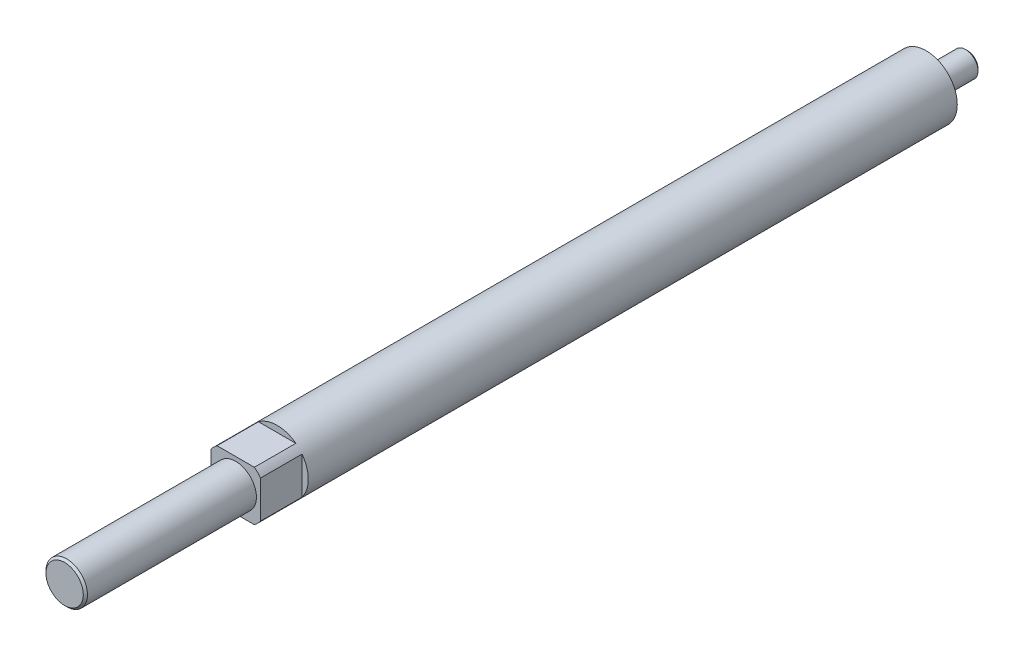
ISO-10303-21;
HEADER;
FILE_DESCRIPTION(('STEP AP214'),'2;1');
FILE_NAME('part.step','',(''),(''),'','','');
FILE_SCHEMA(('AUTOMOTIVE_DESIGN { 1 0 10303 214 1 1 1 1 }'));
ENDSEC;
DATA;
#1=APPLICATION_CONTEXT('core data for automotive mechanical design processes');
#2=APPLICATION_PROTOCOL_DEFINITION('international standard','automotive_design',2000,#1);
#3=PRODUCT_CONTEXT('',#1,'mechanical');
#4=PRODUCT('Part','Part','',(#3));
#5=PRODUCT_RELATED_PRODUCT_CATEGORY('part','',(#4));
#6=PRODUCT_DEFINITION_FORMATION('','',#4);
#7=PRODUCT_DEFINITION_CONTEXT('part definition',#1,'design');
#8=PRODUCT_DEFINITION('design','',#6,#7);
#9=PRODUCT_DEFINITION_SHAPE('','',#8);
#10=(LENGTH_UNIT() NAMED_UNIT(*) SI_UNIT(.MILLI.,.METRE.));
#11=(NAMED_UNIT(*) PLANE_ANGLE_UNIT() SI_UNIT($,.RADIAN.));
#12=(NAMED_UNIT(*) SI_UNIT($,.STERADIAN.) SOLID_ANGLE_UNIT());
#13=UNCERTAINTY_MEASURE_WITH_UNIT(LENGTH_MEASURE(1.E-05),#10,'distance_accuracy_value','');
#14=(GEOMETRIC_REPRESENTATION_CONTEXT(3) GLOBAL_UNCERTAINTY_ASSIGNED_CONTEXT((#13)) GLOBAL_UNIT_ASSIGNED_CONTEXT((#10,
#11,#12)) REPRESENTATION_CONTEXT('',''));
#15=CARTESIAN_POINT('',(0.,0.,0.));
#16=DIRECTION('',(0.,0.,1.));
#17=DIRECTION('',(1.,0.,0.));
#18=AXIS2_PLACEMENT_3D('',#15,#16,#17);
#19=CARTESIAN_POINT('',(0.,-1.59594559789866E-13,353.));
#20=DIRECTION('',(0.,0.,1.));
#21=DIRECTION('',(1.00000000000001,0.,0.));
#22=AXIS2_PLACEMENT_3D('',#19,#20,#21);
#23=PLANE('',#22);
#24=DIRECTION('',(0.,-1.00000000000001,0.));
#25=VECTOR('',#24,1.);
#26=CARTESIAN_POINT('',(12.0000000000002,12.,353.));
#27=LINE('',#26,#25);
#28=CARTESIAN_POINT('',(12.0000000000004,9.00000000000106,353.));
#29=VERTEX_POINT('',#28);
#30=CARTESIAN_POINT('',(12.0000000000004,-9.0000000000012,353.));
#31=VERTEX_POINT('',#30);
#32=EDGE_CURVE('E31',#29,#31,#27,.T.);
#33=ORIENTED_EDGE('',*,*,#32,.F.);
#34=CARTESIAN_POINT('',(0.,-1.59594559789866E-13,353.));
#35=DIRECTION('',(0.,0.,1.));
#36=DIRECTION('',(1.00000000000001,0.,0.));
#37=AXIS2_PLACEMENT_3D('',#34,#35,#36);
#38=CIRCLE('',#37,15.0000000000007);
#39=CARTESIAN_POINT('',(9.00000000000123,12.,353.));
#40=VERTEX_POINT('',#39);
#41=EDGE_CURVE('E101',#29,#40,#38,.T.);
#42=ORIENTED_EDGE('',*,*,#41,.T.);
#43=DIRECTION('',(1.00000000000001,0.,0.));
#44=VECTOR('',#43,1.);
#45=CARTESIAN_POINT('',(12.0000000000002,12.,353.));
#46=LINE('',#45,#44);
#47=CARTESIAN_POINT('',(-9.00000000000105,12.,353.));
#48=VERTEX_POINT('',#47);
#49=EDGE_CURVE('E84',#48,#40,#46,.T.);
#50=ORIENTED_EDGE('',*,*,#49,.F.);
#51=CARTESIAN_POINT('',(-12.,9.00000000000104,353.));
#52=VERTEX_POINT('',#51);
#53=EDGE_CURVE('E99',#48,#52,#38,.T.);
#54=ORIENTED_EDGE('',*,*,#53,.T.);
#55=DIRECTION('',(0.,1.00000000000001,0.));
#56=VECTOR('',#55,1.);
#57=CARTESIAN_POINT('',(-12.,12.,353.));
#58=LINE('',#57,#56);
#59=CARTESIAN_POINT('',(-12.,-9.00000000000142,353.));
#60=VERTEX_POINT('',#59);
#61=EDGE_CURVE('E103',#60,#52,#58,.T.);
#62=ORIENTED_EDGE('',*,*,#61,.F.);
#63=CARTESIAN_POINT('',(-9.00000000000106,-12.0000000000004,353.));
#64=VERTEX_POINT('',#63);
#65=EDGE_CURVE('E109',#60,#64,#38,.T.);
#66=ORIENTED_EDGE('',*,*,#65,.T.);
#67=DIRECTION('',(-1.00000000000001,0.,0.));
#68=VECTOR('',#67,1.);
#69=CARTESIAN_POINT('',(12.0000000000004,-12.0000000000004,353.));
#70=LINE('',#69,#68);
#71=CARTESIAN_POINT('',(9.00000000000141,-12.0000000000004,353.));
#72=VERTEX_POINT('',#71);
#73=EDGE_CURVE('E39',#72,#64,#70,.T.);
#74=ORIENTED_EDGE('',*,*,#73,.F.);
#75=EDGE_CURVE('E112',#72,#31,#38,.T.);
#76=ORIENTED_EDGE('',*,*,#75,.T.);
#77=EDGE_LOOP('',(#33,#42,#50,#54,#62,#66,#74,#76));
#78=FACE_BOUND('',#77,.T.);
#79=CARTESIAN_POINT('',(0.,-1.59594559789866E-13,353.));
#80=DIRECTION('',(0.,0.,1.));
#81=DIRECTION('',(1.00000000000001,0.,0.));
#82=AXIS2_PLACEMENT_3D('',#79,#80,#81);
#83=CIRCLE('',#82,10.);
#84=CARTESIAN_POINT('',(10.0000000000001,-1.59594559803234E-13,353.));
#85=VERTEX_POINT('',#84);
#86=EDGE_CURVE('E116',#85,#85,#83,.T.);
#87=ORIENTED_EDGE('',*,*,#86,.F.);
#88=EDGE_LOOP('',(#87));
#89=FACE_BOUND('',#88,.T.);
#90=ADVANCED_FACE('F16',(#78,#89),#23,.T.);
#91=CARTESIAN_POINT('',(0.,-1.87350135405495E-13,20.));
#92=DIRECTION('',(0.,0.,1.));
#93=DIRECTION('',(1.00000000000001,0.,0.));
#94=AXIS2_PLACEMENT_3D('',#91,#92,#93);
#95=PLANE('',#94);
#96=CARTESIAN_POINT('',(0.,-1.87350135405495E-13,20.));
#97=DIRECTION('',(0.,0.,1.));
#98=DIRECTION('',(1.00000000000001,0.,0.));
#99=AXIS2_PLACEMENT_3D('',#96,#97,#98);
#100=CIRCLE('',#99,15.0000000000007);
#101=CARTESIAN_POINT('',(15.0000000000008,-1.87350135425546E-13,20.));
#102=VERTEX_POINT('',#101);
#103=EDGE_CURVE('E118',#102,#102,#100,.T.);
#104=ORIENTED_EDGE('',*,*,#103,.F.);
#105=EDGE_LOOP('',(#104));
#106=FACE_BOUND('',#105,.T.);
#107=CARTESIAN_POINT('',(0.,-1.87350135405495E-13,20.));
#108=DIRECTION('',(0.,0.,-1.));
#109=DIRECTION('',(-1.00000000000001,0.,0.));
#110=AXIS2_PLACEMENT_3D('',#107,#108,#109);
#111=CIRCLE('',#110,5.);
#112=CARTESIAN_POINT('',(-5.0000000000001,-1.87350135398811E-13,20.));
#113=VERTEX_POINT('',#112);
#114=EDGE_CURVE('E173',#113,#113,#111,.T.);
#115=ORIENTED_EDGE('',*,*,#114,.F.);
#116=EDGE_LOOP('',(#115));
#117=FACE_BOUND('',#116,.T.);
#118=ADVANCED_FACE('F182',(#106,#117),#95,.F.);
#119=CARTESIAN_POINT('',(0.,-1.59594559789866E-13,353.));
#120=DIRECTION('',(0.,0.,-1.));
#121=DIRECTION('',(-1.00000000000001,0.,0.));
#122=AXIS2_PLACEMENT_3D('',#119,#120,#121);
#123=CYLINDRICAL_SURFACE('',#122,15.0000000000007);
#124=ORIENTED_EDGE('',*,*,#41,.F.);
#125=DIRECTION('',(0.,0.,-1.));
#126=VECTOR('',#125,1.);
#127=CARTESIAN_POINT('',(12.0000000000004,9.00000000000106,353.));
#128=LINE('',#127,#126);
#129=CARTESIAN_POINT('',(12.0000000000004,9.00000000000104,333.));
#130=VERTEX_POINT('',#129);
#131=EDGE_CURVE('E11',#29,#130,#128,.T.);
#132=ORIENTED_EDGE('',*,*,#131,.T.);
#133=CARTESIAN_POINT('',(0.,0.,333.));
#134=DIRECTION('',(0.,0.,-1.));
#135=DIRECTION('',(-1.00000000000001,0.,0.));
#136=AXIS2_PLACEMENT_3D('',#133,#134,#135);
#137=CIRCLE('',#136,15.0000000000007);
#138=CARTESIAN_POINT('',(12.0000000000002,-9.00000000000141,333.));
#139=VERTEX_POINT('',#138);
#140=EDGE_CURVE('E24',#130,#139,#137,.T.);
#141=ORIENTED_EDGE('',*,*,#140,.T.);
#142=DIRECTION('',(0.,0.,-1.));
#143=VECTOR('',#142,1.);
#144=CARTESIAN_POINT('',(12.0000000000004,-9.0000000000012,353.));
#145=LINE('',#144,#143);
#146=EDGE_CURVE('E145',#139,#31,#145,.F.);
#147=ORIENTED_EDGE('',*,*,#146,.T.);
#148=ORIENTED_EDGE('',*,*,#75,.F.);
#149=DIRECTION('',(0.,0.,-1.));
#150=VECTOR('',#149,1.);
#151=CARTESIAN_POINT('',(9.00000000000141,-12.0000000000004,353.));
#152=LINE('',#151,#150);
#153=CARTESIAN_POINT('',(9.00000000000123,-12.0000000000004,333.));
#154=VERTEX_POINT('',#153);
#155=EDGE_CURVE('E143',#72,#154,#152,.T.);
#156=ORIENTED_EDGE('',*,*,#155,.T.);
#157=CARTESIAN_POINT('',(-9.00000000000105,-12.0000000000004,333.));
#158=VERTEX_POINT('',#157);
#159=EDGE_CURVE('E142',#154,#158,#137,.T.);
#160=ORIENTED_EDGE('',*,*,#159,.T.);
#161=DIRECTION('',(0.,0.,-1.));
#162=VECTOR('',#161,1.);
#163=CARTESIAN_POINT('',(-9.00000000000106,-12.0000000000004,353.));
#164=LINE('',#163,#162);
#165=EDGE_CURVE('E140',#158,#64,#164,.F.);
#166=ORIENTED_EDGE('',*,*,#165,.T.);
#167=ORIENTED_EDGE('',*,*,#65,.F.);
#168=DIRECTION('',(0.,0.,-1.));
#169=VECTOR('',#168,1.);
#170=CARTESIAN_POINT('',(-12.,-9.00000000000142,353.));
#171=LINE('',#170,#169);
#172=CARTESIAN_POINT('',(-12.,-9.00000000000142,333.));
#173=VERTEX_POINT('',#172);
#174=EDGE_CURVE('E137',#60,#173,#171,.T.);
#175=ORIENTED_EDGE('',*,*,#174,.T.);
#176=CARTESIAN_POINT('',(-11.9999999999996,9.00000000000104,333.));
#177=VERTEX_POINT('',#176);
#178=EDGE_CURVE('E134',#173,#177,#137,.T.);
#179=ORIENTED_EDGE('',*,*,#178,.T.);
#180=DIRECTION('',(0.,0.,-1.));
#181=VECTOR('',#180,1.);
#182=CARTESIAN_POINT('',(-12.,9.00000000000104,353.));
#183=LINE('',#182,#181);
#184=EDGE_CURVE('E91',#177,#52,#183,.F.);
#185=ORIENTED_EDGE('',*,*,#184,.T.);
#186=ORIENTED_EDGE('',*,*,#53,.F.);
#187=DIRECTION('',(0.,0.,-1.));
#188=VECTOR('',#187,1.);
#189=CARTESIAN_POINT('',(-9.00000000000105,12.,353.));
#190=LINE('',#189,#188);
#191=CARTESIAN_POINT('',(-9.00000000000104,12.,333.));
#192=VERTEX_POINT('',#191);
#193=EDGE_CURVE('E81',#48,#192,#190,.T.);
#194=ORIENTED_EDGE('',*,*,#193,.T.);
#195=CARTESIAN_POINT('',(9.00000000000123,12.,333.));
#196=VERTEX_POINT('',#195);
#197=EDGE_CURVE('E92',#192,#196,#137,.T.);
#198=ORIENTED_EDGE('',*,*,#197,.T.);
#199=DIRECTION('',(0.,0.,-1.));
#200=VECTOR('',#199,1.);
#201=CARTESIAN_POINT('',(9.00000000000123,12.,353.));
#202=LINE('',#201,#200);
#203=EDGE_CURVE('E132',#196,#40,#202,.F.);
#204=ORIENTED_EDGE('',*,*,#203,.T.);
#205=EDGE_LOOP('',(#124,#132,#141,#147,#148,#156,#160,#166,#167,#175,#179,#185,#186,#194,#198,#204));
#206=FACE_BOUND('',#205,.T.);
#207=ORIENTED_EDGE('',*,*,#103,.T.);
#208=EDGE_LOOP('',(#207));
#209=FACE_BOUND('',#208,.T.);
#210=ADVANCED_FACE('F106',(#206,#209),#123,.T.);
#211=CARTESIAN_POINT('',(0.,-1.17961196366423E-13,435.5));
#212=DIRECTION('',(0.,0.,-1.));
#213=DIRECTION('',(-1.00000000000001,0.,0.));
#214=AXIS2_PLACEMENT_3D('',#211,#212,#213);
#215=CYLINDRICAL_SURFACE('',#214,10.);
#216=CARTESIAN_POINT('',(0.,-1.17961196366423E-13,434.5));
#217=DIRECTION('',(0.,0.,1.));
#218=DIRECTION('',(1.00000000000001,0.,0.));
#219=AXIS2_PLACEMENT_3D('',#216,#217,#218);
#220=CIRCLE('',#219,10.);
#221=CARTESIAN_POINT('',(10.0000000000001,-1.1796119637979E-13,434.5));
#222=VERTEX_POINT('',#221);
#223=EDGE_CURVE('E129',#222,#222,#220,.F.);
#224=ORIENTED_EDGE('',*,*,#223,.T.);
#225=EDGE_LOOP('',(#224));
#226=FACE_BOUND('',#225,.T.);
#227=ORIENTED_EDGE('',*,*,#86,.T.);
#228=EDGE_LOOP('',(#227));
#229=FACE_BOUND('',#228,.T.);
#230=ADVANCED_FACE('F180',(#226,#229),#215,.T.);
#231=CARTESIAN_POINT('',(0.,-1.17961196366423E-13,435.5));
#232=DIRECTION('',(0.,0.,1.));
#233=DIRECTION('',(1.00000000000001,0.,0.));
#234=AXIS2_PLACEMENT_3D('',#231,#232,#233);
#235=PLANE('',#234);
#236=CARTESIAN_POINT('',(0.,-1.17961196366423E-13,435.5));
#237=DIRECTION('',(0.,0.,1.));
#238=DIRECTION('',(1.00000000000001,0.,0.));
#239=AXIS2_PLACEMENT_3D('',#236,#237,#238);
#240=CIRCLE('',#239,9.);
#241=CARTESIAN_POINT('',(9.00000000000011,-1.17961196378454E-13,435.5));
#242=VERTEX_POINT('',#241);
#243=EDGE_CURVE('E126',#242,#242,#240,.T.);
#244=ORIENTED_EDGE('',*,*,#243,.T.);
#245=EDGE_LOOP('',(#244));
#246=FACE_BOUND('',#245,.T.);
#247=ADVANCED_FACE('F285',(#246),#235,.T.);
#248=CARTESIAN_POINT('',(0.,-1.17961196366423E-13,435.5));
#249=DIRECTION('',(0.,0.,-1.));
#250=DIRECTION('',(-1.00000000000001,0.,0.));
#251=AXIS2_PLACEMENT_3D('',#248,#249,#250);
#252=CONICAL_SURFACE('',#251,9.,0.785398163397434);
#253=ORIENTED_EDGE('',*,*,#223,.F.);
#254=EDGE_LOOP('',(#253));
#255=FACE_BOUND('',#254,.T.);
#256=ORIENTED_EDGE('',*,*,#243,.F.);
#257=EDGE_LOOP('',(#256));
#258=FACE_BOUND('',#257,.T.);
#259=ADVANCED_FACE('F18',(#255,#258),#252,.T.);
#260=CARTESIAN_POINT('',(0.,0.,0.));
#261=DIRECTION('',(0.,0.,-1.));
#262=DIRECTION('',(-1.00000000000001,0.,0.));
#263=AXIS2_PLACEMENT_3D('',#260,#261,#262);
#264=CYLINDRICAL_SURFACE('',#263,5.);
#265=CARTESIAN_POINT('',(0.,-1.87350135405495E-13,17.));
#266=DIRECTION('',(0.,0.,-1.));
#267=DIRECTION('',(-1.00000000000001,0.,0.));
#268=AXIS2_PLACEMENT_3D('',#265,#266,#267);
#269=CIRCLE('',#268,5.);
#270=CARTESIAN_POINT('',(-5.0000000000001,-1.87350135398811E-13,17.));
#271=VERTEX_POINT('',#270);
#272=EDGE_CURVE('E171',#271,#271,#269,.T.);
#273=ORIENTED_EDGE('',*,*,#272,.F.);
#274=EDGE_LOOP('',(#273));
#275=FACE_BOUND('',#274,.T.);
#276=ORIENTED_EDGE('',*,*,#114,.T.);
#277=EDGE_LOOP('',(#276));
#278=FACE_BOUND('',#277,.T.);
#279=ADVANCED_FACE('F281',(#275,#278),#264,.T.);
#280=CARTESIAN_POINT('',(-6.00000000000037,-1.87350135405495E-13,17.0000000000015));
#281=DIRECTION('',(0.,0.,-1.));
#282=DIRECTION('',(-1.00000000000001,0.,0.));
#283=AXIS2_PLACEMENT_3D('',#280,#281,#282);
#284=PLANE('',#283);
#285=CARTESIAN_POINT('',(0.,-1.87350135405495E-13,17.));
#286=DIRECTION('',(0.,0.,-1.));
#287=DIRECTION('',(-1.00000000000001,0.,0.));
#288=AXIS2_PLACEMENT_3D('',#285,#286,#287);
#289=CIRCLE('',#288,6.);
#290=CARTESIAN_POINT('',(-6.00000000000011,-1.87350135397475E-13,17.));
#291=VERTEX_POINT('',#290);
#292=EDGE_CURVE('E160',#291,#291,#289,.T.);
#293=ORIENTED_EDGE('',*,*,#292,.F.);
#294=EDGE_LOOP('',(#293));
#295=FACE_BOUND('',#294,.T.);
#296=ORIENTED_EDGE('',*,*,#272,.T.);
#297=EDGE_LOOP('',(#296));
#298=FACE_BOUND('',#297,.T.);
#299=ADVANCED_FACE('F199',(#295,#298),#284,.F.);
#300=CARTESIAN_POINT('',(0.,0.,0.));
#301=DIRECTION('',(0.,0.,1.));
#302=DIRECTION('',(1.00000000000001,0.,0.));
#303=AXIS2_PLACEMENT_3D('',#300,#301,#302);
#304=PLANE('',#303);
#305=CARTESIAN_POINT('',(0.,0.,0.));
#306=DIRECTION('',(0.,0.,1.));
#307=DIRECTION('',(1.00000000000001,0.,0.));
#308=AXIS2_PLACEMENT_3D('',#305,#306,#307);
#309=CIRCLE('',#308,5.);
#310=CARTESIAN_POINT('',(5.00000000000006,0.,0.));
#311=VERTEX_POINT('',#310);
#312=EDGE_CURVE('E123',#311,#311,#309,.F.);
#313=ORIENTED_EDGE('',*,*,#312,.T.);
#314=EDGE_LOOP('',(#313));
#315=FACE_BOUND('',#314,.T.);
#316=ADVANCED_FACE('F195',(#315),#304,.F.);
#317=CARTESIAN_POINT('',(0.,0.,1.));
#318=DIRECTION('',(0.,0.,1.));
#319=DIRECTION('',(1.00000000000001,0.,0.));
#320=AXIS2_PLACEMENT_3D('',#317,#318,#319);
#321=CONICAL_SURFACE('',#320,6.,0.78539816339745);
#322=ORIENTED_EDGE('',*,*,#312,.F.);
#323=EDGE_LOOP('',(#322));
#324=FACE_BOUND('',#323,.T.);
#325=CARTESIAN_POINT('',(0.,0.,1.));
#326=DIRECTION('',(0.,0.,1.));
#327=DIRECTION('',(1.00000000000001,0.,0.));
#328=AXIS2_PLACEMENT_3D('',#325,#326,#327);
#329=CIRCLE('',#328,6.);
#330=CARTESIAN_POINT('',(6.00000000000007,0.,1.));
#331=VERTEX_POINT('',#330);
#332=EDGE_CURVE('E111',#331,#331,#329,.T.);
#333=ORIENTED_EDGE('',*,*,#332,.F.);
#334=EDGE_LOOP('',(#333));
#335=FACE_BOUND('',#334,.T.);
#336=ADVANCED_FACE('F198',(#324,#335),#321,.T.);
#337=CARTESIAN_POINT('',(0.,-1.87350135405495E-13,20.));
#338=DIRECTION('',(0.,0.,-1.));
#339=DIRECTION('',(-1.00000000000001,0.,0.));
#340=AXIS2_PLACEMENT_3D('',#337,#338,#339);
#341=CYLINDRICAL_SURFACE('',#340,6.);
#342=ORIENTED_EDGE('',*,*,#292,.T.);
#343=EDGE_LOOP('',(#342));
#344=FACE_BOUND('',#343,.T.);
#345=ORIENTED_EDGE('',*,*,#332,.T.);
#346=EDGE_LOOP('',(#345));
#347=FACE_BOUND('',#346,.T.);
#348=ADVANCED_FACE('F201',(#344,#347),#341,.T.);
#349=CARTESIAN_POINT('',(12.0000000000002,12.,333.));
#350=DIRECTION('',(0.,-1.00000000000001,0.));
#351=DIRECTION('',(0.,0.,-1.));
#352=AXIS2_PLACEMENT_3D('',#349,#350,#351);
#353=PLANE('',#352);
#354=ORIENTED_EDGE('',*,*,#49,.T.);
#355=ORIENTED_EDGE('',*,*,#203,.F.);
#356=DIRECTION('',(1.00000000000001,0.,0.));
#357=VECTOR('',#356,1.);
#358=CARTESIAN_POINT('',(12.0000000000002,12.,333.));
#359=LINE('',#358,#357);
#360=EDGE_CURVE('E87',#192,#196,#359,.T.);
#361=ORIENTED_EDGE('',*,*,#360,.F.);
#362=ORIENTED_EDGE('',*,*,#193,.F.);
#363=EDGE_LOOP('',(#354,#355,#361,#362));
#364=FACE_BOUND('',#363,.T.);
#365=ADVANCED_FACE('F83',(#364),#353,.F.);
#366=CARTESIAN_POINT('',(0.,0.,333.));
#367=DIRECTION('',(0.,0.,-1.));
#368=DIRECTION('',(-1.00000000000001,0.,0.));
#369=AXIS2_PLACEMENT_3D('',#366,#367,#368);
#370=PLANE('',#369);
#371=ORIENTED_EDGE('',*,*,#360,.T.);
#372=ORIENTED_EDGE('',*,*,#197,.F.);
#373=EDGE_LOOP('',(#371,#372));
#374=FACE_BOUND('',#373,.T.);
#375=ADVANCED_FACE('F228',(#374),#370,.F.);
#376=CARTESIAN_POINT('',(-12.,12.,333.));
#377=DIRECTION('',(1.00000000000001,0.,0.));
#378=DIRECTION('',(0.,0.,-1.));
#379=AXIS2_PLACEMENT_3D('',#376,#377,#378);
#380=PLANE('',#379);
#381=ORIENTED_EDGE('',*,*,#61,.T.);
#382=ORIENTED_EDGE('',*,*,#184,.F.);
#383=DIRECTION('',(0.,1.00000000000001,0.));
#384=VECTOR('',#383,1.);
#385=CARTESIAN_POINT('',(-12.,12.,333.));
#386=LINE('',#385,#384);
#387=EDGE_CURVE('E155',#173,#177,#386,.T.);
#388=ORIENTED_EDGE('',*,*,#387,.F.);
#389=ORIENTED_EDGE('',*,*,#174,.F.);
#390=EDGE_LOOP('',(#381,#382,#388,#389));
#391=FACE_BOUND('',#390,.T.);
#392=ADVANCED_FACE('F157',(#391),#380,.F.);
#393=ORIENTED_EDGE('',*,*,#387,.T.);
#394=ORIENTED_EDGE('',*,*,#178,.F.);
#395=EDGE_LOOP('',(#393,#394));
#396=FACE_BOUND('',#395,.T.);
#397=ADVANCED_FACE('F154',(#396),#370,.F.);
#398=CARTESIAN_POINT('',(12.0000000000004,-12.0000000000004,333.));
#399=DIRECTION('',(0.,1.00000000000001,0.));
#400=DIRECTION('',(0.,0.,1.));
#401=AXIS2_PLACEMENT_3D('',#398,#399,#400);
#402=PLANE('',#401);
#403=ORIENTED_EDGE('',*,*,#73,.T.);
#404=ORIENTED_EDGE('',*,*,#165,.F.);
#405=DIRECTION('',(-1.00000000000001,0.,0.));
#406=VECTOR('',#405,1.);
#407=CARTESIAN_POINT('',(12.0000000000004,-12.0000000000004,333.));
#408=LINE('',#407,#406);
#409=EDGE_CURVE('E158',#154,#158,#408,.T.);
#410=ORIENTED_EDGE('',*,*,#409,.F.);
#411=ORIENTED_EDGE('',*,*,#155,.F.);
#412=EDGE_LOOP('',(#403,#404,#410,#411));
#413=FACE_BOUND('',#412,.T.);
#414=ADVANCED_FACE('F249',(#413),#402,.F.);
#415=ORIENTED_EDGE('',*,*,#409,.T.);
#416=ORIENTED_EDGE('',*,*,#159,.F.);
#417=EDGE_LOOP('',(#415,#416));
#418=FACE_BOUND('',#417,.T.);
#419=ADVANCED_FACE('F250',(#418),#370,.F.);
#420=DIRECTION('',(0.,-1.00000000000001,0.));
#421=VECTOR('',#420,1.);
#422=CARTESIAN_POINT('',(12.0000000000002,12.,333.));
#423=LINE('',#422,#421);
#424=EDGE_CURVE('E102',#130,#139,#423,.T.);
#425=ORIENTED_EDGE('',*,*,#424,.T.);
#426=ORIENTED_EDGE('',*,*,#140,.F.);
#427=EDGE_LOOP('',(#425,#426));
#428=FACE_BOUND('',#427,.T.);
#429=ADVANCED_FACE('F237',(#428),#370,.F.);
#430=CARTESIAN_POINT('',(12.0000000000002,12.,333.));
#431=DIRECTION('',(-1.00000000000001,0.,0.));
#432=DIRECTION('',(0.,0.,1.));
#433=AXIS2_PLACEMENT_3D('',#430,#431,#432);
#434=PLANE('',#433);
#435=ORIENTED_EDGE('',*,*,#32,.T.);
#436=ORIENTED_EDGE('',*,*,#146,.F.);
#437=ORIENTED_EDGE('',*,*,#424,.F.);
#438=ORIENTED_EDGE('',*,*,#131,.F.);
#439=EDGE_LOOP('',(#435,#436,#437,#438));
#440=FACE_BOUND('',#439,.T.);
#441=ADVANCED_FACE('F268',(#440),#434,.F.);
#442=CLOSED_SHELL('',(#90,#118,#210,#230,#247,#259,#279,#299,#316,#336,#348,#365,#375,#392,#397,
#414,#419,#429,#441));
#443=MANIFOLD_SOLID_BREP('B1',#442);
#444=ADVANCED_BREP_SHAPE_REPRESENTATION('',(#18,#443),#14);
#445=SHAPE_DEFINITION_REPRESENTATION(#9,#444);
ENDSEC;
END-ISO-10303-21;
